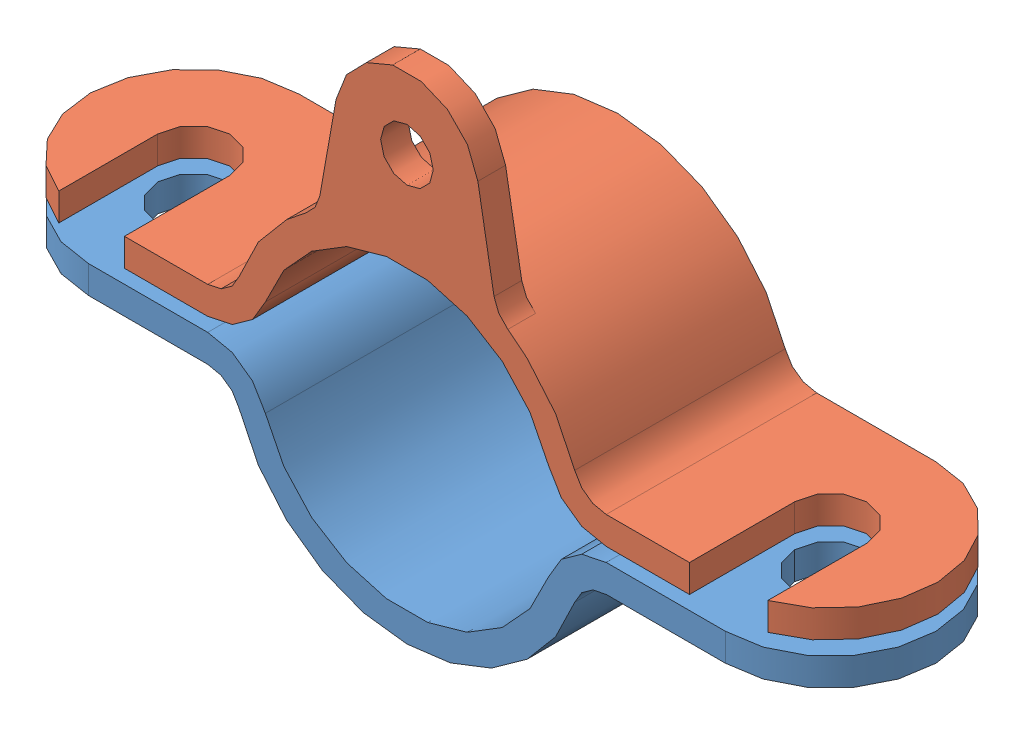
SolidWorks assembly Clamp_Assy_&.SLDASM, configuration Default (file format 13000). Lengths in mm.
Overall size (153 89.5 38).
2 component instances, 2 part files, 0 mates.
Components (placement in the parent):
- Clamp_Bottom_&-1: Clamp_Bottom_&.SLDPRT [Default] at origin size (153 30.75 38)
- Clamp_Top_&-1: Clamp_Top_&.SLDPRT [Default] at origin size (153 56.25 38)
